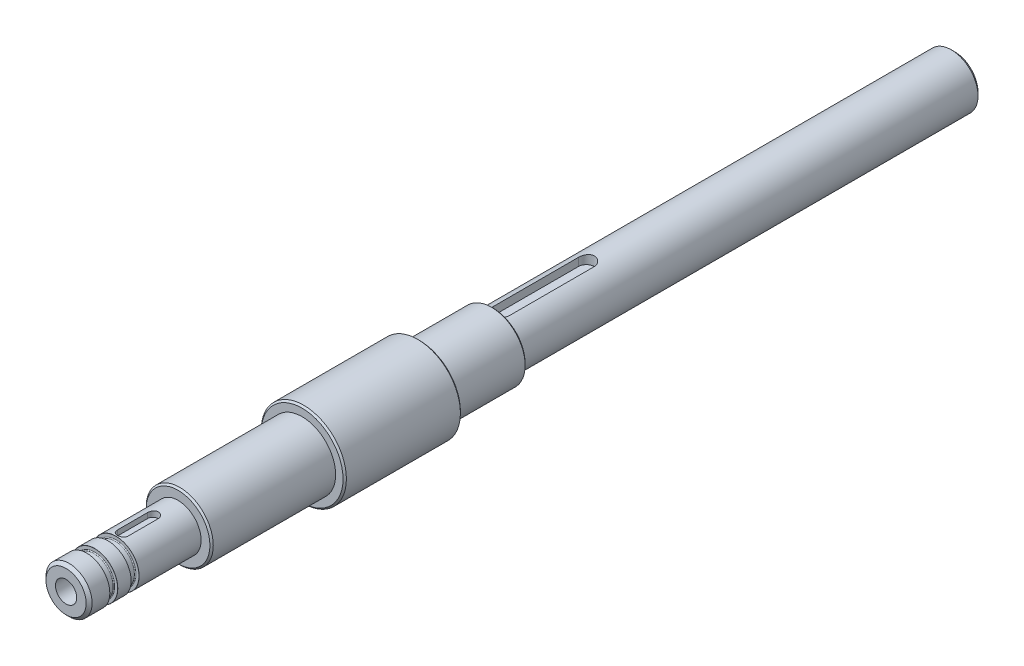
ISO-10303-21;
HEADER;
FILE_DESCRIPTION(('STEP AP214'),'2;1');
FILE_NAME('part.step','',(''),(''),'','','');
FILE_SCHEMA(('AUTOMOTIVE_DESIGN { 1 0 10303 214 1 1 1 1 }'));
ENDSEC;
DATA;
#1=APPLICATION_CONTEXT('core data for automotive mechanical design processes');
#2=APPLICATION_PROTOCOL_DEFINITION('international standard','automotive_design',2000,#1);
#3=PRODUCT_CONTEXT('',#1,'mechanical');
#4=PRODUCT('Part','Part','',(#3));
#5=PRODUCT_RELATED_PRODUCT_CATEGORY('part','',(#4));
#6=PRODUCT_DEFINITION_FORMATION('','',#4);
#7=PRODUCT_DEFINITION_CONTEXT('part definition',#1,'design');
#8=PRODUCT_DEFINITION('design','',#6,#7);
#9=PRODUCT_DEFINITION_SHAPE('','',#8);
#10=(LENGTH_UNIT() NAMED_UNIT(*) SI_UNIT(.MILLI.,.METRE.));
#11=(NAMED_UNIT(*) PLANE_ANGLE_UNIT() SI_UNIT($,.RADIAN.));
#12=(NAMED_UNIT(*) SI_UNIT($,.STERADIAN.) SOLID_ANGLE_UNIT());
#13=UNCERTAINTY_MEASURE_WITH_UNIT(LENGTH_MEASURE(1.E-05),#10,'distance_accuracy_value','');
#14=(GEOMETRIC_REPRESENTATION_CONTEXT(3) GLOBAL_UNCERTAINTY_ASSIGNED_CONTEXT((#13)) GLOBAL_UNIT_ASSIGNED_CONTEXT((#10,
#11,#12)) REPRESENTATION_CONTEXT('',''));
#15=CARTESIAN_POINT('',(0.,0.,0.));
#16=DIRECTION('',(0.,0.,1.));
#17=DIRECTION('',(1.,0.,0.));
#18=AXIS2_PLACEMENT_3D('',#15,#16,#17);
#19=CARTESIAN_POINT('',(0.,0.,150.));
#20=DIRECTION('',(0.,0.,-1.));
#21=DIRECTION('',(-1.,0.,0.));
#22=AXIS2_PLACEMENT_3D('',#19,#20,#21);
#23=CONICAL_SURFACE('',#22,6.00000000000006,0.785398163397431);
#24=CARTESIAN_POINT('',(0.,0.,150.));
#25=DIRECTION('',(0.,0.,1.));
#26=DIRECTION('',(1.,0.,0.));
#27=AXIS2_PLACEMENT_3D('',#24,#25,#26);
#28=CIRCLE('',#27,6.00000000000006);
#29=CARTESIAN_POINT('',(6.00000000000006,0.,150.));
#30=VERTEX_POINT('',#29);
#31=EDGE_CURVE('E219',#30,#30,#28,.T.);
#32=ORIENTED_EDGE('',*,*,#31,.F.);
#33=EDGE_LOOP('',(#32));
#34=FACE_BOUND('',#33,.T.);
#35=CARTESIAN_POINT('',(0.,0.,149.1166));
#36=DIRECTION('',(0.,0.,-1.));
#37=DIRECTION('',(-1.,0.,0.));
#38=AXIS2_PLACEMENT_3D('',#35,#36,#37);
#39=CIRCLE('',#38,6.8834);
#40=CARTESIAN_POINT('',(6.8834,0.,149.1166));
#41=VERTEX_POINT('',#40);
#42=EDGE_CURVE('E171',#41,#41,#39,.F.);
#43=ORIENTED_EDGE('',*,*,#42,.T.);
#44=EDGE_LOOP('',(#43));
#45=FACE_BOUND('',#44,.T.);
#46=ADVANCED_FACE('F38',(#34,#45),#23,.T.);
#47=CARTESIAN_POINT('',(0.,0.,-115.));
#48=DIRECTION('',(0.,0.,1.));
#49=DIRECTION('',(1.,0.,0.));
#50=AXIS2_PLACEMENT_3D('',#47,#48,#49);
#51=PLANE('',#50);
#52=CARTESIAN_POINT('',(0.,0.,-115.));
#53=DIRECTION('',(0.,0.,1.));
#54=DIRECTION('',(1.,0.,0.));
#55=AXIS2_PLACEMENT_3D('',#52,#53,#54);
#56=CIRCLE('',#55,6.9375000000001);
#57=CARTESIAN_POINT('',(6.9375000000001,0.,-115.));
#58=VERTEX_POINT('',#57);
#59=EDGE_CURVE('E216',#58,#58,#56,.F.);
#60=ORIENTED_EDGE('',*,*,#59,.T.);
#61=EDGE_LOOP('',(#60));
#62=FACE_BOUND('',#61,.T.);
#63=CARTESIAN_POINT('',(0.,0.,-115.));
#64=DIRECTION('',(0.,0.,1.));
#65=DIRECTION('',(1.,0.,0.));
#66=AXIS2_PLACEMENT_3D('',#63,#64,#65);
#67=CIRCLE('',#66,3.175);
#68=CARTESIAN_POINT('',(3.175,0.,-115.));
#69=VERTEX_POINT('',#68);
#70=EDGE_CURVE('E208',#69,#69,#67,.T.);
#71=ORIENTED_EDGE('',*,*,#70,.T.);
#72=EDGE_LOOP('',(#71));
#73=FACE_BOUND('',#72,.T.);
#74=ADVANCED_FACE('F355',(#62,#73),#51,.F.);
#75=CARTESIAN_POINT('',(0.,0.,79.61));
#76=DIRECTION('',(0.,0.,1.));
#77=DIRECTION('',(1.,0.,0.));
#78=AXIS2_PLACEMENT_3D('',#75,#76,#77);
#79=PLANE('',#78);
#80=CARTESIAN_POINT('',(0.,0.,79.61));
#81=DIRECTION('',(0.,0.,1.));
#82=DIRECTION('',(1.,0.,0.));
#83=AXIS2_PLACEMENT_3D('',#80,#81,#82);
#84=CIRCLE('',#83,12.2);
#85=CARTESIAN_POINT('',(12.2,0.,79.61));
#86=VERTEX_POINT('',#85);
#87=EDGE_CURVE('E237',#86,#86,#84,.T.);
#88=ORIENTED_EDGE('',*,*,#87,.T.);
#89=EDGE_LOOP('',(#88));
#90=FACE_BOUND('',#89,.T.);
#91=CARTESIAN_POINT('',(0.,0.,79.61));
#92=DIRECTION('',(0.,0.,1.));
#93=DIRECTION('',(1.,0.,0.));
#94=AXIS2_PLACEMENT_3D('',#91,#92,#93);
#95=CIRCLE('',#94,10.);
#96=CARTESIAN_POINT('',(10.,0.,79.61));
#97=VERTEX_POINT('',#96);
#98=EDGE_CURVE('E204',#97,#97,#95,.T.);
#99=ORIENTED_EDGE('',*,*,#98,.F.);
#100=EDGE_LOOP('',(#99));
#101=FACE_BOUND('',#100,.T.);
#102=ADVANCED_FACE('F361',(#90,#101),#79,.T.);
#103=CARTESIAN_POINT('',(0.,0.,-115.));
#104=DIRECTION('',(0.,0.,1.));
#105=DIRECTION('',(1.,0.,0.));
#106=AXIS2_PLACEMENT_3D('',#103,#104,#105);
#107=CYLINDRICAL_SURFACE('',#106,12.7);
#108=CARTESIAN_POINT('',(0.,0.,45.11));
#109=DIRECTION('',(0.,0.,1.));
#110=DIRECTION('',(1.,0.,0.));
#111=AXIS2_PLACEMENT_3D('',#108,#109,#110);
#112=CIRCLE('',#111,12.7);
#113=CARTESIAN_POINT('',(12.7,0.,45.11));
#114=VERTEX_POINT('',#113);
#115=EDGE_CURVE('E234',#114,#114,#112,.T.);
#116=ORIENTED_EDGE('',*,*,#115,.T.);
#117=EDGE_LOOP('',(#116));
#118=FACE_BOUND('',#117,.T.);
#119=CARTESIAN_POINT('',(0.,0.,79.11));
#120=DIRECTION('',(0.,0.,1.));
#121=DIRECTION('',(1.,0.,0.));
#122=AXIS2_PLACEMENT_3D('',#119,#120,#121);
#123=CIRCLE('',#122,12.7);
#124=CARTESIAN_POINT('',(12.7,0.,79.11));
#125=VERTEX_POINT('',#124);
#126=EDGE_CURVE('E231',#125,#125,#123,.F.);
#127=ORIENTED_EDGE('',*,*,#126,.T.);
#128=EDGE_LOOP('',(#127));
#129=FACE_BOUND('',#128,.T.);
#130=ADVANCED_FACE('F696',(#118,#129),#107,.T.);
#131=CARTESIAN_POINT('',(0.,0.,150.));
#132=DIRECTION('',(0.,0.,1.));
#133=DIRECTION('',(1.,0.,0.));
#134=AXIS2_PLACEMENT_3D('',#131,#132,#133);
#135=PLANE('',#134);
#136=ORIENTED_EDGE('',*,*,#31,.T.);
#137=EDGE_LOOP('',(#136));
#138=FACE_BOUND('',#137,.T.);
#139=CARTESIAN_POINT('',(0.,0.,150.));
#140=DIRECTION('',(0.,0.,1.));
#141=DIRECTION('',(1.,0.,0.));
#142=AXIS2_PLACEMENT_3D('',#139,#140,#141);
#143=CIRCLE('',#142,3.175);
#144=CARTESIAN_POINT('',(3.175,0.,150.));
#145=VERTEX_POINT('',#144);
#146=EDGE_CURVE('E207',#145,#145,#143,.T.);
#147=ORIENTED_EDGE('',*,*,#146,.F.);
#148=EDGE_LOOP('',(#147));
#149=FACE_BOUND('',#148,.T.);
#150=ADVANCED_FACE('F350',(#138,#149),#135,.T.);
#151=CARTESIAN_POINT('',(0.,0.,-115.));
#152=DIRECTION('',(0.,0.,1.));
#153=DIRECTION('',(1.,0.,0.));
#154=AXIS2_PLACEMENT_3D('',#151,#152,#153);
#155=CYLINDRICAL_SURFACE('',#154,3.175);
#156=ORIENTED_EDGE('',*,*,#70,.F.);
#157=EDGE_LOOP('',(#156));
#158=FACE_BOUND('',#157,.T.);
#159=ORIENTED_EDGE('',*,*,#146,.T.);
#160=EDGE_LOOP('',(#159));
#161=FACE_BOUND('',#160,.T.);
#162=ADVANCED_FACE('F340',(#158,#161),#155,.F.);
#163=CARTESIAN_POINT('',(0.,0.,116.61));
#164=DIRECTION('',(0.,0.,1.));
#165=DIRECTION('',(1.,0.,0.));
#166=AXIS2_PLACEMENT_3D('',#163,#164,#165);
#167=PLANE('',#166);
#168=CARTESIAN_POINT('',(0.,0.,116.61));
#169=DIRECTION('',(0.,0.,1.));
#170=DIRECTION('',(1.,0.,0.));
#171=AXIS2_PLACEMENT_3D('',#168,#169,#170);
#172=CIRCLE('',#171,9.50000000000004);
#173=CARTESIAN_POINT('',(9.50000000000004,0.,116.61));
#174=VERTEX_POINT('',#173);
#175=EDGE_CURVE('E240',#174,#174,#172,.T.);
#176=ORIENTED_EDGE('',*,*,#175,.T.);
#177=EDGE_LOOP('',(#176));
#178=FACE_BOUND('',#177,.T.);
#179=CARTESIAN_POINT('',(0.,0.,116.61));
#180=DIRECTION('',(0.,0.,1.));
#181=DIRECTION('',(1.,0.,0.));
#182=AXIS2_PLACEMENT_3D('',#179,#180,#181);
#183=CIRCLE('',#182,6.8834);
#184=CARTESIAN_POINT('',(6.8834,0.,116.61));
#185=VERTEX_POINT('',#184);
#186=EDGE_CURVE('E151',#185,#185,#183,.F.);
#187=ORIENTED_EDGE('',*,*,#186,.T.);
#188=EDGE_LOOP('',(#187));
#189=FACE_BOUND('',#188,.T.);
#190=ADVANCED_FACE('F337',(#178,#189),#167,.T.);
#191=CARTESIAN_POINT('',(0.,0.,116.61));
#192=DIRECTION('',(0.,0.,-1.));
#193=DIRECTION('',(-1.,0.,0.));
#194=AXIS2_PLACEMENT_3D('',#191,#192,#193);
#195=CYLINDRICAL_SURFACE('',#194,10.);
#196=CARTESIAN_POINT('',(0.,0.,116.11));
#197=DIRECTION('',(0.,0.,1.));
#198=DIRECTION('',(1.,0.,0.));
#199=AXIS2_PLACEMENT_3D('',#196,#197,#198);
#200=CIRCLE('',#199,10.);
#201=CARTESIAN_POINT('',(10.,0.,116.11));
#202=VERTEX_POINT('',#201);
#203=EDGE_CURVE('E243',#202,#202,#200,.F.);
#204=ORIENTED_EDGE('',*,*,#203,.T.);
#205=EDGE_LOOP('',(#204));
#206=FACE_BOUND('',#205,.T.);
#207=ORIENTED_EDGE('',*,*,#98,.T.);
#208=EDGE_LOOP('',(#207));
#209=FACE_BOUND('',#208,.T.);
#210=ADVANCED_FACE('F339',(#206,#209),#195,.T.);
#211=CARTESIAN_POINT('',(0.,0.,44.61));
#212=DIRECTION('',(0.,0.,1.));
#213=DIRECTION('',(1.,0.,0.));
#214=AXIS2_PLACEMENT_3D('',#211,#212,#213);
#215=PLANE('',#214);
#216=CARTESIAN_POINT('',(0.,0.,44.61));
#217=DIRECTION('',(0.,0.,1.));
#218=DIRECTION('',(1.,0.,0.));
#219=AXIS2_PLACEMENT_3D('',#216,#217,#218);
#220=CIRCLE('',#219,12.2);
#221=CARTESIAN_POINT('',(12.2,0.,44.61));
#222=VERTEX_POINT('',#221);
#223=EDGE_CURVE('E228',#222,#222,#220,.F.);
#224=ORIENTED_EDGE('',*,*,#223,.T.);
#225=EDGE_LOOP('',(#224));
#226=FACE_BOUND('',#225,.T.);
#227=CARTESIAN_POINT('',(0.,0.,44.61));
#228=DIRECTION('',(0.,0.,1.));
#229=DIRECTION('',(1.,0.,0.));
#230=AXIS2_PLACEMENT_3D('',#227,#228,#229);
#231=CIRCLE('',#230,10.);
#232=CARTESIAN_POINT('',(10.,0.,44.61));
#233=VERTEX_POINT('',#232);
#234=EDGE_CURVE('E201',#233,#233,#231,.T.);
#235=ORIENTED_EDGE('',*,*,#234,.T.);
#236=EDGE_LOOP('',(#235));
#237=FACE_BOUND('',#236,.T.);
#238=ADVANCED_FACE('F347',(#226,#237),#215,.F.);
#239=CARTESIAN_POINT('',(0.,0.,-115.));
#240=DIRECTION('',(0.,0.,1.));
#241=DIRECTION('',(1.,0.,0.));
#242=AXIS2_PLACEMENT_3D('',#239,#240,#241);
#243=CYLINDRICAL_SURFACE('',#242,10.);
#244=CARTESIAN_POINT('',(0.,0.,23.11));
#245=DIRECTION('',(0.,0.,1.));
#246=DIRECTION('',(1.,0.,0.));
#247=AXIS2_PLACEMENT_3D('',#244,#245,#246);
#248=CIRCLE('',#247,10.);
#249=CARTESIAN_POINT('',(10.,0.,23.11));
#250=VERTEX_POINT('',#249);
#251=EDGE_CURVE('E225',#250,#250,#248,.T.);
#252=ORIENTED_EDGE('',*,*,#251,.T.);
#253=EDGE_LOOP('',(#252));
#254=FACE_BOUND('',#253,.T.);
#255=ORIENTED_EDGE('',*,*,#234,.F.);
#256=EDGE_LOOP('',(#255));
#257=FACE_BOUND('',#256,.T.);
#258=ADVANCED_FACE('F668',(#254,#257),#243,.T.);
#259=CARTESIAN_POINT('',(0.,0.,22.61));
#260=DIRECTION('',(0.,0.,1.));
#261=DIRECTION('',(1.,0.,0.));
#262=AXIS2_PLACEMENT_3D('',#259,#260,#261);
#263=PLANE('',#262);
#264=CARTESIAN_POINT('',(0.,0.,22.61));
#265=DIRECTION('',(0.,0.,1.));
#266=DIRECTION('',(1.,0.,0.));
#267=AXIS2_PLACEMENT_3D('',#264,#265,#266);
#268=CIRCLE('',#267,9.5);
#269=CARTESIAN_POINT('',(9.5,0.,22.61));
#270=VERTEX_POINT('',#269);
#271=EDGE_CURVE('E222',#270,#270,#268,.F.);
#272=ORIENTED_EDGE('',*,*,#271,.T.);
#273=EDGE_LOOP('',(#272));
#274=FACE_BOUND('',#273,.T.);
#275=CARTESIAN_POINT('',(0.,0.,22.61));
#276=DIRECTION('',(0.,0.,1.));
#277=DIRECTION('',(1.,0.,0.));
#278=AXIS2_PLACEMENT_3D('',#275,#276,#277);
#279=CIRCLE('',#278,7.9375);
#280=CARTESIAN_POINT('',(0.,7.9375,22.61));
#281=VERTEX_POINT('',#280);
#282=EDGE_CURVE('E198',#281,#281,#279,.T.);
#283=ORIENTED_EDGE('',*,*,#282,.T.);
#284=EDGE_LOOP('',(#283));
#285=FACE_BOUND('',#284,.T.);
#286=ADVANCED_FACE('F661',(#274,#285),#263,.F.);
#287=CARTESIAN_POINT('',(0.,0.,-115.));
#288=DIRECTION('',(0.,0.,1.));
#289=DIRECTION('',(1.,0.,0.));
#290=AXIS2_PLACEMENT_3D('',#287,#288,#289);
#291=CYLINDRICAL_SURFACE('',#290,7.9375);
#292=CARTESIAN_POINT('',(2.38125,7.57189241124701,-5.17125));
#293=CARTESIAN_POINT('',(2.38125815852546,7.57188330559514,-5.23660381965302));
#294=CARTESIAN_POINT('',(2.378559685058,7.572738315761,-5.30195241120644));
#295=CARTESIAN_POINT('',(2.36781294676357,7.57610889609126,-5.43215082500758));
#296=CARTESIAN_POINT('',(2.35976588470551,7.57862409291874,-5.49700075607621));
#297=CARTESIAN_POINT('',(2.33841242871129,7.58523905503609,-5.62558052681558));
#298=CARTESIAN_POINT('',(2.32511938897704,7.58933479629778,-5.68931278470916));
#299=CARTESIAN_POINT('',(2.29340452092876,7.59897853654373,-5.81535895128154));
#300=CARTESIAN_POINT('',(2.27498255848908,7.60452657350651,-5.87767282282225));
#301=CARTESIAN_POINT('',(2.21224938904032,7.62310862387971,-6.06179732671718));
#302=CARTESIAN_POINT('',(2.16044345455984,7.63808962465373,-6.18095432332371));
#303=CARTESIAN_POINT('',(2.0384694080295,7.67153988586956,-6.40888567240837));
#304=CARTESIAN_POINT('',(1.96829275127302,7.69001076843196,-6.51765516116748));
#305=CARTESIAN_POINT('',(1.80919341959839,7.72901085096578,-6.72519262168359));
#306=CARTESIAN_POINT('',(1.71979363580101,7.74958369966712,-6.82358736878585));
#307=CARTESIAN_POINT('',(1.52580765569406,7.79009767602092,-7.00423593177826));
#308=CARTESIAN_POINT('',(1.4212188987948,7.81003869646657,-7.08648702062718));
#309=CARTESIAN_POINT('',(1.19714960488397,7.84754016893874,-7.23414819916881));
#310=CARTESIAN_POINT('',(1.07740582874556,7.86504286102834,-7.29917483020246));
#311=CARTESIAN_POINT('',(0.828073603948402,7.89518471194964,-7.40801924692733));
#312=CARTESIAN_POINT('',(0.698487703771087,7.9078251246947,-7.45184250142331));
#313=CARTESIAN_POINT('',(0.437077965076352,7.92650878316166,-7.51579664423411));
#314=CARTESIAN_POINT('',(0.305424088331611,7.93273034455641,-7.53656920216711));
#315=CARTESIAN_POINT('',(0.040359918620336,7.93850333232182,-7.55586128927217));
#316=CARTESIAN_POINT('',(-0.0930500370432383,7.93805602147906,-7.5543850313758));
#317=CARTESIAN_POINT('',(-0.353332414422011,7.93066744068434,-7.52965125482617));
#318=CARTESIAN_POINT('',(-0.480277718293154,7.92393347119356,-7.50708901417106));
#319=CARTESIAN_POINT('',(-0.728487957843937,7.90498028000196,-7.44195977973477));
#320=CARTESIAN_POINT('',(-0.849752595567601,7.89276077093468,-7.39939173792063));
#321=CARTESIAN_POINT('',(-1.08481465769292,7.86392278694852,-7.29498809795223));
#322=CARTESIAN_POINT('',(-1.19850853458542,7.84725468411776,-7.23293363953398));
#323=CARTESIAN_POINT('',(-1.41409027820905,7.8112877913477,-7.09149223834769));
#324=CARTESIAN_POINT('',(-1.5159754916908,7.79198841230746,-7.01210141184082));
#325=CARTESIAN_POINT('',(-1.70918902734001,7.75194781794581,-6.83464521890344));
#326=CARTESIAN_POINT('',(-1.79996070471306,7.73117969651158,-6.73597911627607));
#327=CARTESIAN_POINT('',(-1.96384496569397,7.69118691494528,-6.52459784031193));
#328=CARTESIAN_POINT('',(-2.0369523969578,7.67196270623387,-6.41187858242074));
#329=CARTESIAN_POINT('',(-2.1640229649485,7.63710100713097,-6.17410402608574));
#330=CARTESIAN_POINT('',(-2.21778522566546,7.62150171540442,-6.04893560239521));
#331=CARTESIAN_POINT('',(-2.30323844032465,7.59611866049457,-5.79081234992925));
#332=CARTESIAN_POINT('',(-2.33496315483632,7.58632600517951,-5.65786977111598));
#333=CARTESIAN_POINT('',(-2.36380660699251,7.57736026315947,-5.46494561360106));
#334=CARTESIAN_POINT('',(-2.37034709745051,7.57531435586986,-5.40637345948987));
#335=CARTESIAN_POINT('',(-2.37906489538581,7.57258024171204,-5.28896077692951));
#336=CARTESIAN_POINT('',(-2.38124861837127,7.57189003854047,-5.23012077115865));
#337=CARTESIAN_POINT('',(-2.38125,7.57189241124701,-5.17125));
#338=B_SPLINE_CURVE_WITH_KNOTS('',3,(#292,#293,#294,#295,#296,#297,#298,#299,#300,#301,#302,
#303,#304,#305,#306,#307,#308,#309,#310,#311,#312,#313,#314,#315,#316,#317,#318,#319,#320,#321,
#322,#323,#324,#325,#326,#327,#328,#329,#330,#331,#332,#333,#334,#335,#336,#337),.UNSPECIFIED.,
.F.,.F.,(4,2,2,2,2,2,2,2,2,2,2,2,2,2,2,2,2,2,2,2,2,2,4),(0.,0.195991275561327,0.391938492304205,
0.587390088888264,0.782846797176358,1.17326844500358,1.56387201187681,1.96560376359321,
2.36740331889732,2.77751230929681,3.1875154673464,3.58579420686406,3.98399753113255,
4.36951721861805,4.7550571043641,5.14509213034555,5.53521462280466,5.94033955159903,
6.34558250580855,6.7549196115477,7.16362823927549,7.34039575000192,7.51690277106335),.UNSPECIFIED.);
#339=CARTESIAN_POINT('',(2.38125,7.57189241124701,-5.17125));
#340=VERTEX_POINT('',#339);
#341=CARTESIAN_POINT('',(-2.38125,7.57189241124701,-5.17125));
#342=VERTEX_POINT('',#341);
#343=EDGE_CURVE('E258',#340,#342,#338,.T.);
#344=ORIENTED_EDGE('',*,*,#343,.F.);
#345=DIRECTION('',(0.,0.,1.));
#346=VECTOR('',#345,1.);
#347=CARTESIAN_POINT('',(2.38124999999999,7.57189241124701,-115.));
#348=LINE('',#347,#346);
#349=CARTESIAN_POINT('',(2.38125,7.57189241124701,20.22875));
#350=VERTEX_POINT('',#349);
#351=EDGE_CURVE('E300',#350,#340,#348,.F.);
#352=ORIENTED_EDGE('',*,*,#351,.F.);
#353=CARTESIAN_POINT('',(-2.38125,7.57189241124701,20.22875));
#354=CARTESIAN_POINT('',(-2.38125815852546,7.57188330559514,20.294103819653));
#355=CARTESIAN_POINT('',(-2.378559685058,7.572738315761,20.3594524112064));
#356=CARTESIAN_POINT('',(-2.36781294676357,7.57610889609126,20.4896508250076));
#357=CARTESIAN_POINT('',(-2.35976588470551,7.57862409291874,20.5545007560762));
#358=CARTESIAN_POINT('',(-2.3384124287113,7.58523905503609,20.6830805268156));
#359=CARTESIAN_POINT('',(-2.32511938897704,7.58933479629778,20.7468127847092));
#360=CARTESIAN_POINT('',(-2.29340452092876,7.59897853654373,20.8728589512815));
#361=CARTESIAN_POINT('',(-2.27498255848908,7.60452657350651,20.9351728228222));
#362=CARTESIAN_POINT('',(-2.21224938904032,7.62310862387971,21.1192973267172));
#363=CARTESIAN_POINT('',(-2.16044345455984,7.63808962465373,21.2384543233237));
#364=CARTESIAN_POINT('',(-2.0384694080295,7.67153988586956,21.4663856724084));
#365=CARTESIAN_POINT('',(-1.96829275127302,7.69001076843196,21.5751551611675));
#366=CARTESIAN_POINT('',(-1.80919341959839,7.72901085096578,21.7826926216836));
#367=CARTESIAN_POINT('',(-1.71979363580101,7.74958369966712,21.8810873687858));
#368=CARTESIAN_POINT('',(-1.52580765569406,7.79009767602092,22.0617359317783));
#369=CARTESIAN_POINT('',(-1.4212188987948,7.81003869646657,22.1439870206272));
#370=CARTESIAN_POINT('',(-1.19714960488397,7.84754016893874,22.2916481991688));
#371=CARTESIAN_POINT('',(-1.07740582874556,7.86504286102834,22.3566748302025));
#372=CARTESIAN_POINT('',(-0.828073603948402,7.89518471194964,22.4655192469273));
#373=CARTESIAN_POINT('',(-0.698487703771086,7.9078251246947,22.5093425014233));
#374=CARTESIAN_POINT('',(-0.43707796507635,7.92650878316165,22.5732966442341));
#375=CARTESIAN_POINT('',(-0.305424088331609,7.93273034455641,22.5940692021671));
#376=CARTESIAN_POINT('',(-0.0403599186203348,7.93850333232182,22.6133612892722));
#377=CARTESIAN_POINT('',(0.0930500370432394,7.93805602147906,22.6118850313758));
#378=CARTESIAN_POINT('',(0.353332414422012,7.93066744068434,22.5871512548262));
#379=CARTESIAN_POINT('',(0.480277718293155,7.92393347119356,22.5645890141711));
#380=CARTESIAN_POINT('',(0.728487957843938,7.90498028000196,22.4994597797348));
#381=CARTESIAN_POINT('',(0.849752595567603,7.89276077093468,22.4568917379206));
#382=CARTESIAN_POINT('',(1.08481465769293,7.86392278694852,22.3524880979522));
#383=CARTESIAN_POINT('',(1.19850853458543,7.84725468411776,22.290433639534));
#384=CARTESIAN_POINT('',(1.41409027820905,7.8112877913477,22.1489922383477));
#385=CARTESIAN_POINT('',(1.5159754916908,7.79198841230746,22.0696014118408));
#386=CARTESIAN_POINT('',(1.70918902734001,7.75194781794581,21.8921452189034));
#387=CARTESIAN_POINT('',(1.79996070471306,7.73117969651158,21.7934791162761));
#388=CARTESIAN_POINT('',(1.96384496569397,7.69118691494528,21.5820978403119));
#389=CARTESIAN_POINT('',(2.03695239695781,7.67196270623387,21.4693785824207));
#390=CARTESIAN_POINT('',(2.16402296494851,7.63710100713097,21.2316040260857));
#391=CARTESIAN_POINT('',(2.21778522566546,7.62150171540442,21.1064356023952));
#392=CARTESIAN_POINT('',(2.30323844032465,7.59611866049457,20.8483123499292));
#393=CARTESIAN_POINT('',(2.33496315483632,7.58632600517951,20.715369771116));
#394=CARTESIAN_POINT('',(2.36380660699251,7.57736026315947,20.5224456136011));
#395=CARTESIAN_POINT('',(2.37034709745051,7.57531435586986,20.4638734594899));
#396=CARTESIAN_POINT('',(2.37906489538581,7.57258024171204,20.3464607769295));
#397=CARTESIAN_POINT('',(2.38124861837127,7.57189003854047,20.2876207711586));
#398=CARTESIAN_POINT('',(2.38125,7.57189241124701,20.22875));
#399=B_SPLINE_CURVE_WITH_KNOTS('',3,(#353,#354,#355,#356,#357,#358,#359,#360,#361,#362,#363,
#364,#365,#366,#367,#368,#369,#370,#371,#372,#373,#374,#375,#376,#377,#378,#379,#380,#381,#382,
#383,#384,#385,#386,#387,#388,#389,#390,#391,#392,#393,#394,#395,#396,#397,#398),.UNSPECIFIED.,
.F.,.F.,(4,2,2,2,2,2,2,2,2,2,2,2,2,2,2,2,2,2,2,2,2,2,4),(0.,0.195991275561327,0.391938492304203,
0.587390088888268,0.782846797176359,1.17326844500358,1.56387201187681,1.96560376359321,
2.36740331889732,2.77751230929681,3.1875154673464,3.58579420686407,3.98399753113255,
4.36951721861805,4.7550571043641,5.14509213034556,5.53521462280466,5.94033955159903,
6.34558250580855,6.7549196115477,7.1636282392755,7.34039575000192,7.51690277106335),.UNSPECIFIED.);
#400=EDGE_CURVE('E294',#281,#350,#399,.T.);
#401=ORIENTED_EDGE('',*,*,#400,.F.);
#402=ORIENTED_EDGE('',*,*,#282,.F.);
#403=CARTESIAN_POINT('',(-2.38125,7.57189241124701,20.22875));
#404=VERTEX_POINT('',#403);
#405=EDGE_CURVE('E299',#404,#281,#399,.T.);
#406=ORIENTED_EDGE('',*,*,#405,.F.);
#407=DIRECTION('',(0.,0.,1.));
#408=VECTOR('',#407,1.);
#409=CARTESIAN_POINT('',(-2.38124999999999,7.57189241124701,-115.));
#410=LINE('',#409,#408);
#411=EDGE_CURVE('E267',#342,#404,#410,.T.);
#412=ORIENTED_EDGE('',*,*,#411,.F.);
#413=EDGE_LOOP('',(#344,#352,#401,#402,#406,#412));
#414=FACE_BOUND('',#413,.T.);
#415=CARTESIAN_POINT('',(0.,0.,-114.));
#416=DIRECTION('',(0.,0.,1.));
#417=DIRECTION('',(1.,0.,0.));
#418=AXIS2_PLACEMENT_3D('',#415,#416,#417);
#419=CIRCLE('',#418,7.9375);
#420=CARTESIAN_POINT('',(7.9375,0.,-114.));
#421=VERTEX_POINT('',#420);
#422=EDGE_CURVE('E211',#421,#421,#419,.T.);
#423=ORIENTED_EDGE('',*,*,#422,.T.);
#424=EDGE_LOOP('',(#423));
#425=FACE_BOUND('',#424,.T.);
#426=ADVANCED_FACE('F269',(#414,#425),#291,.T.);
#427=CARTESIAN_POINT('',(0.,0.,-114.));
#428=DIRECTION('',(0.,0.,1.));
#429=DIRECTION('',(1.,0.,0.));
#430=AXIS2_PLACEMENT_3D('',#427,#428,#429);
#431=CONICAL_SURFACE('',#430,7.9375,0.785398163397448);
#432=ORIENTED_EDGE('',*,*,#59,.F.);
#433=EDGE_LOOP('',(#432));
#434=FACE_BOUND('',#433,.T.);
#435=ORIENTED_EDGE('',*,*,#422,.F.);
#436=EDGE_LOOP('',(#435));
#437=FACE_BOUND('',#436,.T.);
#438=ADVANCED_FACE('F368',(#434,#437),#431,.T.);
#439=CARTESIAN_POINT('',(0.,0.,22.61));
#440=DIRECTION('',(0.,0.,1.));
#441=DIRECTION('',(1.,0.,0.));
#442=AXIS2_PLACEMENT_3D('',#439,#440,#441);
#443=CONICAL_SURFACE('',#442,9.50000000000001,0.78539816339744);
#444=ORIENTED_EDGE('',*,*,#251,.F.);
#445=EDGE_LOOP('',(#444));
#446=FACE_BOUND('',#445,.T.);
#447=ORIENTED_EDGE('',*,*,#271,.F.);
#448=EDGE_LOOP('',(#447));
#449=FACE_BOUND('',#448,.T.);
#450=ADVANCED_FACE('F370',(#446,#449),#443,.T.);
#451=CARTESIAN_POINT('',(0.,0.,44.61));
#452=DIRECTION('',(0.,0.,1.));
#453=DIRECTION('',(1.,0.,0.));
#454=AXIS2_PLACEMENT_3D('',#451,#452,#453);
#455=CONICAL_SURFACE('',#454,12.2,0.785398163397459);
#456=ORIENTED_EDGE('',*,*,#115,.F.);
#457=EDGE_LOOP('',(#456));
#458=FACE_BOUND('',#457,.T.);
#459=ORIENTED_EDGE('',*,*,#223,.F.);
#460=EDGE_LOOP('',(#459));
#461=FACE_BOUND('',#460,.T.);
#462=ADVANCED_FACE('F373',(#458,#461),#455,.T.);
#463=CARTESIAN_POINT('',(0.,0.,79.11));
#464=DIRECTION('',(0.,0.,-1.));
#465=DIRECTION('',(-1.,0.,0.));
#466=AXIS2_PLACEMENT_3D('',#463,#464,#465);
#467=CONICAL_SURFACE('',#466,12.7,0.785398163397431);
#468=ORIENTED_EDGE('',*,*,#87,.F.);
#469=EDGE_LOOP('',(#468));
#470=FACE_BOUND('',#469,.T.);
#471=ORIENTED_EDGE('',*,*,#126,.F.);
#472=EDGE_LOOP('',(#471));
#473=FACE_BOUND('',#472,.T.);
#474=ADVANCED_FACE('F377',(#470,#473),#467,.T.);
#475=CARTESIAN_POINT('',(0.,0.,116.61));
#476=DIRECTION('',(0.,0.,-1.));
#477=DIRECTION('',(-1.,0.,0.));
#478=AXIS2_PLACEMENT_3D('',#475,#476,#477);
#479=CONICAL_SURFACE('',#478,9.50000000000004,0.785398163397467);
#480=ORIENTED_EDGE('',*,*,#203,.F.);
#481=EDGE_LOOP('',(#480));
#482=FACE_BOUND('',#481,.T.);
#483=ORIENTED_EDGE('',*,*,#175,.F.);
#484=EDGE_LOOP('',(#483));
#485=FACE_BOUND('',#484,.T.);
#486=ADVANCED_FACE('F331',(#482,#485),#479,.T.);
#487=CARTESIAN_POINT('',(0.,0.,67.1157833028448));
#488=DIRECTION('',(0.,0.,1.));
#489=DIRECTION('',(1.,0.,0.));
#490=AXIS2_PLACEMENT_3D('',#487,#488,#489);
#491=CYLINDRICAL_SURFACE('',#490,6.8834);
#492=CARTESIAN_POINT('',(1.5875,6.69783840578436,124.108035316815));
#493=CARTESIAN_POINT('',(1.58750041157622,6.69783572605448,124.064008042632));
#494=CARTESIAN_POINT('',(1.58566727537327,6.69827306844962,124.020002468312));
#495=CARTESIAN_POINT('',(1.57835879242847,6.70000000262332,123.932318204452));
#496=CARTESIAN_POINT('',(1.57288399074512,6.70128946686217,123.888639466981));
#497=CARTESIAN_POINT('',(1.55107251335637,6.70638546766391,123.758730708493));
#498=CARTESIAN_POINT('',(1.52934845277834,6.71141990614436,123.673389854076));
#499=CARTESIAN_POINT('',(1.47222183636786,6.72418049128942,123.507692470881));
#500=CARTESIAN_POINT('',(1.43681940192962,6.73190661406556,123.427335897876));
#501=CARTESIAN_POINT('',(1.35337774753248,6.74917576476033,123.273668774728));
#502=CARTESIAN_POINT('',(1.30533599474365,6.75871915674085,123.200359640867));
#503=CARTESIAN_POINT('',(1.19702990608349,6.77874543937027,123.061538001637));
#504=CARTESIAN_POINT('',(1.13657448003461,6.78924137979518,122.996176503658));
#505=CARTESIAN_POINT('',(1.00556323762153,6.80987727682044,122.876419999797));
#506=CARTESIAN_POINT('',(0.935005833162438,6.82001717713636,122.822026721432));
#507=CARTESIAN_POINT('',(0.784769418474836,6.8389416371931,122.725149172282));
#508=CARTESIAN_POINT('',(0.704993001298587,6.84770887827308,122.682812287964));
#509=CARTESIAN_POINT('',(0.539225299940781,6.8627507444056,122.612206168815));
#510=CARTESIAN_POINT('',(0.453235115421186,6.86902580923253,122.583934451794));
#511=CARTESIAN_POINT('',(0.279059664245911,6.87828407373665,122.542739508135));
#512=CARTESIAN_POINT('',(0.190938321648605,6.88132247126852,122.529558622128));
#513=CARTESIAN_POINT('',(0.0136842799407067,6.88395674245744,122.51811263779));
#514=CARTESIAN_POINT('',(-0.0754483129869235,6.88355297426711,122.519845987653));
#515=CARTESIAN_POINT('',(-0.250410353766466,6.87939005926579,122.53799034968));
#516=CARTESIAN_POINT('',(-0.33627039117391,6.87569451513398,122.554123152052));
#517=CARTESIAN_POINT('',(-0.504029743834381,6.86543636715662,122.600163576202));
#518=CARTESIAN_POINT('',(-0.585928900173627,6.8588736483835,122.630071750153));
#519=CARTESIAN_POINT('',(-0.744201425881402,6.84351796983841,122.703052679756));
#520=CARTESIAN_POINT('',(-0.820525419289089,6.83470761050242,122.746228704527));
#521=CARTESIAN_POINT('',(-0.964942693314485,6.81581933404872,122.844441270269));
#522=CARTESIAN_POINT('',(-1.03303495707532,6.80574126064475,122.899479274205));
#523=CARTESIAN_POINT('',(-1.16070731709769,6.78514831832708,123.021351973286));
#524=CARTESIAN_POINT('',(-1.22005572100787,6.77462873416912,123.088428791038));
#525=CARTESIAN_POINT('',(-1.32672251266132,6.75455094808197,123.231713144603));
#526=CARTESIAN_POINT('',(-1.37403761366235,6.74499300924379,123.307923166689));
#527=CARTESIAN_POINT('',(-1.45541664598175,6.72790463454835,123.467726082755));
#528=CARTESIAN_POINT('',(-1.48942491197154,6.72038275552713,123.551348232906));
#529=CARTESIAN_POINT('',(-1.54278888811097,6.70833504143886,123.723284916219));
#530=CARTESIAN_POINT('',(-1.56216643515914,6.70380474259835,123.81159224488));
#531=CARTESIAN_POINT('',(-1.57844690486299,6.69997870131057,123.935206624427));
#532=CARTESIAN_POINT('',(-1.5818426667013,6.69917717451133,123.969709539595));
#533=CARTESIAN_POINT('',(-1.58636653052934,6.6981073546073,124.038814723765));
#534=CARTESIAN_POINT('',(-1.58749836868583,6.69783818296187,124.073416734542));
#535=CARTESIAN_POINT('',(-1.5875,6.69783840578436,124.108035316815));
#536=B_SPLINE_CURVE_WITH_KNOTS('',3,(#492,#493,#494,#495,#496,#497,#498,#499,#500,#501,#502,
#503,#504,#505,#506,#507,#508,#509,#510,#511,#512,#513,#514,#515,#516,#517,#518,#519,#520,#521,
#522,#523,#524,#525,#526,#527,#528,#529,#530,#531,#532,#533,#534,#535),.UNSPECIFIED.,.F.,.F.,(4,
2,2,2,2,2,2,2,2,2,2,2,2,2,2,2,2,2,2,2,2,4),(0.,0.131998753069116,0.263977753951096,
0.527230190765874,0.790480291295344,1.05378318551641,1.32149244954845,1.58924384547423,
1.86014022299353,2.13098877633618,2.39714049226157,2.66326451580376,2.9243554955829,
3.18545694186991,3.44864445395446,3.71186444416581,3.98113604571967,4.25048111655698,
4.52094116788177,4.79099674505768,4.89497170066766,4.99877492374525),.UNSPECIFIED.);
#537=CARTESIAN_POINT('',(1.5875,6.69783840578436,124.108035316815));
#538=VERTEX_POINT('',#537);
#539=CARTESIAN_POINT('',(-1.5875,6.69783840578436,124.108035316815));
#540=VERTEX_POINT('',#539);
#541=EDGE_CURVE('E302',#538,#540,#536,.T.);
#542=ORIENTED_EDGE('',*,*,#541,.F.);
#543=DIRECTION('',(0.,0.,1.));
#544=VECTOR('',#543,1.);
#545=CARTESIAN_POINT('',(1.58749999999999,6.69783840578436,67.1157833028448));
#546=LINE('',#545,#544);
#547=CARTESIAN_POINT('',(1.5875,6.69783840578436,133.108035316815));
#548=VERTEX_POINT('',#547);
#549=EDGE_CURVE('E12',#548,#538,#546,.F.);
#550=ORIENTED_EDGE('',*,*,#549,.F.);
#551=CARTESIAN_POINT('',(-1.5875,6.69783840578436,133.108035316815));
#552=CARTESIAN_POINT('',(-1.58750041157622,6.69783572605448,133.152062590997));
#553=CARTESIAN_POINT('',(-1.58566727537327,6.69827306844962,133.196068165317));
#554=CARTESIAN_POINT('',(-1.57835879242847,6.70000000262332,133.283752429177));
#555=CARTESIAN_POINT('',(-1.57288399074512,6.70128946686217,133.327431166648));
#556=CARTESIAN_POINT('',(-1.55107251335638,6.70638546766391,133.457339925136));
#557=CARTESIAN_POINT('',(-1.52934845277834,6.71141990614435,133.542680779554));
#558=CARTESIAN_POINT('',(-1.47222183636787,6.72418049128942,133.708378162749));
#559=CARTESIAN_POINT('',(-1.43681940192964,6.73190661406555,133.788734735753));
#560=CARTESIAN_POINT('',(-1.35337774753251,6.74917576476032,133.942401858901));
#561=CARTESIAN_POINT('',(-1.30533599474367,6.75871915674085,134.015710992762));
#562=CARTESIAN_POINT('',(-1.19702990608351,6.77874543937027,134.154532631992));
#563=CARTESIAN_POINT('',(-1.13657448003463,6.78924137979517,134.219894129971));
#564=CARTESIAN_POINT('',(-1.00556323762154,6.80987727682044,134.339650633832));
#565=CARTESIAN_POINT('',(-0.935005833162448,6.82001717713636,134.394043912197));
#566=CARTESIAN_POINT('',(-0.784769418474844,6.8389416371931,134.490921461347));
#567=CARTESIAN_POINT('',(-0.704993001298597,6.84770887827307,134.533258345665));
#568=CARTESIAN_POINT('',(-0.539225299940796,6.8627507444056,134.603864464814));
#569=CARTESIAN_POINT('',(-0.453235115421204,6.86902580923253,134.632136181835));
#570=CARTESIAN_POINT('',(-0.279059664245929,6.87828407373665,134.673331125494));
#571=CARTESIAN_POINT('',(-0.190938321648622,6.88132247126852,134.686512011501));
#572=CARTESIAN_POINT('',(-0.0136842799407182,6.88395674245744,134.697957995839));
#573=CARTESIAN_POINT('',(0.0754483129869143,6.88355297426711,134.696224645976));
#574=CARTESIAN_POINT('',(0.25041035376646,6.87939005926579,134.678080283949));
#575=CARTESIAN_POINT('',(0.336270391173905,6.87569451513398,134.661947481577));
#576=CARTESIAN_POINT('',(0.504029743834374,6.86543636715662,134.615907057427));
#577=CARTESIAN_POINT('',(0.585928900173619,6.8588736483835,134.585998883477));
#578=CARTESIAN_POINT('',(0.744201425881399,6.84351796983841,134.513017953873));
#579=CARTESIAN_POINT('',(0.82052541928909,6.83470761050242,134.469841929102));
#580=CARTESIAN_POINT('',(0.964942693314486,6.81581933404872,134.37162936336));
#581=CARTESIAN_POINT('',(1.03303495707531,6.80574126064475,134.316591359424));
#582=CARTESIAN_POINT('',(1.16070731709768,6.78514831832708,134.194718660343));
#583=CARTESIAN_POINT('',(1.22005572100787,6.77462873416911,134.127641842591));
#584=CARTESIAN_POINT('',(1.32672251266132,6.75455094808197,133.984357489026));
#585=CARTESIAN_POINT('',(1.37403761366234,6.74499300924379,133.90814746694));
#586=CARTESIAN_POINT('',(1.45541664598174,6.72790463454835,133.748344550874));
#587=CARTESIAN_POINT('',(1.48942491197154,6.72038275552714,133.664722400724));
#588=CARTESIAN_POINT('',(1.54278888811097,6.70833504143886,133.49278571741));
#589=CARTESIAN_POINT('',(1.56216643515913,6.70380474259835,133.404478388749));
#590=CARTESIAN_POINT('',(1.57844690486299,6.69997870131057,133.280864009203));
#591=CARTESIAN_POINT('',(1.5818426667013,6.69917717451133,133.246361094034));
#592=CARTESIAN_POINT('',(1.58636653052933,6.6981073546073,133.177255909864));
#593=CARTESIAN_POINT('',(1.58749836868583,6.69783818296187,133.142653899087));
#594=CARTESIAN_POINT('',(1.5875,6.69783840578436,133.108035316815));
#595=B_SPLINE_CURVE_WITH_KNOTS('',3,(#551,#552,#553,#554,#555,#556,#557,#558,#559,#560,#561,
#562,#563,#564,#565,#566,#567,#568,#569,#570,#571,#572,#573,#574,#575,#576,#577,#578,#579,#580,
#581,#582,#583,#584,#585,#586,#587,#588,#589,#590,#591,#592,#593,#594),.UNSPECIFIED.,.F.,.F.,(4,
2,2,2,2,2,2,2,2,2,2,2,2,2,2,2,2,2,2,2,2,4),(0.,0.131998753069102,0.263977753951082,
0.527230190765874,0.790480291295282,1.05378318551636,1.32149244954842,1.58924384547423,
1.86014022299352,2.13098877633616,2.39714049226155,2.66326451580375,2.9243554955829,
3.1854569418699,3.44864445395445,3.71186444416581,3.98113604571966,4.25048111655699,
4.52094116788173,4.79099674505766,4.89497170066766,4.99877492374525),.UNSPECIFIED.);
#596=CARTESIAN_POINT('',(-1.5875,6.69783840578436,133.108035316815));
#597=VERTEX_POINT('',#596);
#598=EDGE_CURVE('E46',#597,#548,#595,.T.);
#599=ORIENTED_EDGE('',*,*,#598,.F.);
#600=DIRECTION('',(0.,0.,1.));
#601=VECTOR('',#600,1.);
#602=CARTESIAN_POINT('',(-1.58750000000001,6.69783840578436,67.1157833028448));
#603=LINE('',#602,#601);
#604=EDGE_CURVE('E308',#540,#597,#603,.T.);
#605=ORIENTED_EDGE('',*,*,#604,.F.);
#606=EDGE_LOOP('',(#542,#550,#599,#605));
#607=FACE_BOUND('',#606,.T.);
#608=CARTESIAN_POINT('',(0.,0.,135.108035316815));
#609=DIRECTION('',(0.,0.,-1.));
#610=DIRECTION('',(-1.,0.,0.));
#611=AXIS2_PLACEMENT_3D('',#608,#609,#610);
#612=CIRCLE('',#611,6.8834);
#613=CARTESIAN_POINT('',(-6.8834,0.,135.108035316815));
#614=VERTEX_POINT('',#613);
#615=EDGE_CURVE('E161',#614,#614,#612,.F.);
#616=ORIENTED_EDGE('',*,*,#615,.F.);
#617=EDGE_LOOP('',(#616));
#618=FACE_BOUND('',#617,.T.);
#619=ORIENTED_EDGE('',*,*,#186,.F.);
#620=EDGE_LOOP('',(#619));
#621=FACE_BOUND('',#620,.T.);
#622=ADVANCED_FACE('F291',(#607,#618,#621),#491,.T.);
#623=CARTESIAN_POINT('',(0.,0.,143.841964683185));
#624=DIRECTION('',(0.,0.,1.));
#625=DIRECTION('',(1.,0.,0.));
#626=AXIS2_PLACEMENT_3D('',#623,#624,#625);
#627=CIRCLE('',#626,6.8834);
#628=CARTESIAN_POINT('',(6.8834,0.,143.841964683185));
#629=VERTEX_POINT('',#628);
#630=EDGE_CURVE('E168',#629,#629,#627,.F.);
#631=CARTESIAN_POINT('',(6.8834,0.,149.1166));
#632=CARTESIAN_POINT('',(6.8834,0.,149.061655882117));
#633=CARTESIAN_POINT('',(6.8834,0.,149.006711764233));
#634=CARTESIAN_POINT('',(6.8834,0.,148.896823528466));
#635=CARTESIAN_POINT('',(6.8834,0.,148.841879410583));
#636=CARTESIAN_POINT('',(6.8834,0.,148.731991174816));
#637=CARTESIAN_POINT('',(6.8834,0.,148.677047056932));
#638=CARTESIAN_POINT('',(6.8834,0.,148.567158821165));
#639=CARTESIAN_POINT('',(6.8834,0.,148.512214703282));
#640=CARTESIAN_POINT('',(6.8834,0.,148.402326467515));
#641=CARTESIAN_POINT('',(6.8834,0.,148.347382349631));
#642=CARTESIAN_POINT('',(6.8834,0.,148.237494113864));
#643=CARTESIAN_POINT('',(6.8834,0.,148.182549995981));
#644=CARTESIAN_POINT('',(6.8834,0.,148.072661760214));
#645=CARTESIAN_POINT('',(6.8834,0.,148.01771764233));
#646=CARTESIAN_POINT('',(6.8834,0.,147.907829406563));
#647=CARTESIAN_POINT('',(6.8834,0.,147.85288528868));
#648=CARTESIAN_POINT('',(6.8834,0.,147.742997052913));
#649=CARTESIAN_POINT('',(6.8834,0.,147.688052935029));
#650=CARTESIAN_POINT('',(6.8834,0.,147.578164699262));
#651=CARTESIAN_POINT('',(6.8834,0.,147.523220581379));
#652=CARTESIAN_POINT('',(6.8834,0.,147.413332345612));
#653=CARTESIAN_POINT('',(6.8834,0.,147.358388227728));
#654=CARTESIAN_POINT('',(6.8834,0.,147.248499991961));
#655=CARTESIAN_POINT('',(6.8834,0.,147.193555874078));
#656=CARTESIAN_POINT('',(6.8834,0.,147.083667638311));
#657=CARTESIAN_POINT('',(6.8834,0.,147.028723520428));
#658=CARTESIAN_POINT('',(6.8834,0.,146.918835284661));
#659=CARTESIAN_POINT('',(6.8834,0.,146.863891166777));
#660=CARTESIAN_POINT('',(6.8834,0.,146.75400293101));
#661=CARTESIAN_POINT('',(6.8834,0.,146.699058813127));
#662=CARTESIAN_POINT('',(6.8834,0.,146.58917057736));
#663=CARTESIAN_POINT('',(6.8834,0.,146.534226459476));
#664=CARTESIAN_POINT('',(6.8834,0.,146.424338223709));
#665=CARTESIAN_POINT('',(6.8834,0.,146.369394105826));
#666=CARTESIAN_POINT('',(6.8834,0.,146.259505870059));
#667=CARTESIAN_POINT('',(6.8834,0.,146.204561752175));
#668=CARTESIAN_POINT('',(6.8834,0.,146.094673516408));
#669=CARTESIAN_POINT('',(6.8834,0.,146.039729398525));
#670=CARTESIAN_POINT('',(6.8834,0.,145.929841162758));
#671=CARTESIAN_POINT('',(6.8834,0.,145.874897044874));
#672=CARTESIAN_POINT('',(6.8834,0.,145.765008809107));
#673=CARTESIAN_POINT('',(6.8834,0.,145.710064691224));
#674=CARTESIAN_POINT('',(6.8834,0.,145.600176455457));
#675=CARTESIAN_POINT('',(6.8834,0.,145.545232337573));
#676=CARTESIAN_POINT('',(6.8834,0.,145.435344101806));
#677=CARTESIAN_POINT('',(6.8834,0.,145.380399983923));
#678=CARTESIAN_POINT('',(6.8834,0.,145.270511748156));
#679=CARTESIAN_POINT('',(6.8834,0.,145.215567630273));
#680=CARTESIAN_POINT('',(6.8834,0.,145.105679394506));
#681=CARTESIAN_POINT('',(6.8834,0.,145.050735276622));
#682=CARTESIAN_POINT('',(6.8834,0.,144.940847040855));
#683=CARTESIAN_POINT('',(6.8834,0.,144.885902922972));
#684=CARTESIAN_POINT('',(6.8834,0.,144.776014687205));
#685=CARTESIAN_POINT('',(6.8834,0.,144.721070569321));
#686=CARTESIAN_POINT('',(6.8834,0.,144.611182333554));
#687=CARTESIAN_POINT('',(6.8834,0.,144.556238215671));
#688=CARTESIAN_POINT('',(6.8834,0.,144.446349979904));
#689=CARTESIAN_POINT('',(6.8834,0.,144.39140586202));
#690=CARTESIAN_POINT('',(6.8834,0.,144.281517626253));
#691=CARTESIAN_POINT('',(6.8834,0.,144.22657350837));
#692=CARTESIAN_POINT('',(6.8834,0.,144.116685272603));
#693=CARTESIAN_POINT('',(6.8834,0.,144.061741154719));
#694=CARTESIAN_POINT('',(6.8834,0.,143.951852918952));
#695=CARTESIAN_POINT('',(6.8834,0.,143.896908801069));
#696=CARTESIAN_POINT('',(6.8834,0.,143.841964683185));
#697=B_SPLINE_CURVE_WITH_KNOTS('',3,(#631,#632,#633,#634,#635,#636,#637,#638,#639,#640,#641,
#642,#643,#644,#645,#646,#647,#648,#649,#650,#651,#652,#653,#654,#655,#656,#657,#658,#659,#660,
#661,#662,#663,#664,#665,#666,#667,#668,#669,#670,#671,#672,#673,#674,#675,#676,#677,#678,#679,
#680,#681,#682,#683,#684,#685,#686,#687,#688,#689,#690,#691,#692,#693,#694,#695,#696),
.UNSPECIFIED.,.F.,.F.,(4,2,2,2,2,2,2,2,2,2,2,2,2,2,2,2,2,2,2,2,2,2,2,2,2,2,2,2,2,2,2,2,4),(0.,
0.164832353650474,0.329664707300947,0.494497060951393,0.659329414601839,0.824161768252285,
0.988994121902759,1.15382647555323,1.31865882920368,1.48349118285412,1.6483235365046,
1.81315589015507,1.97798824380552,2.14282059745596,2.30765295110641,2.47248530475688,
2.63731765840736,2.8021500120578,2.96698236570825,3.13181471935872,3.2966470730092,
3.46147942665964,3.62631178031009,3.79114413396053,3.95597648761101,4.12080884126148,
4.28564119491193,4.45047354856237,4.61530590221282,4.78013825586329,4.94497060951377,
5.10980296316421,5.27463531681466),.UNSPECIFIED.);
#698=EDGE_CURVE('BSEAM330',#41,#629,#697,.T.);
#699=ORIENTED_EDGE('',*,*,#42,.F.);
#700=ORIENTED_EDGE('',*,*,#630,.F.);
#701=ORIENTED_EDGE('',*,*,#698,.T.);
#702=ORIENTED_EDGE('',*,*,#698,.F.);
#703=EDGE_LOOP('',(#699,#701,#700,#702));
#704=FACE_BOUND('',#703,.T.);
#705=ADVANCED_FACE('F330',(#704),#491,.T.);
#706=CARTESIAN_POINT('',(0.,0.,137.2271));
#707=DIRECTION('',(0.,0.,-1.));
#708=DIRECTION('',(-1.,0.,0.));
#709=AXIS2_PLACEMENT_3D('',#706,#707,#708);
#710=TOROIDAL_SURFACE('',#709,5.97139999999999,0.254000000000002);
#711=CARTESIAN_POINT('',(0.,0.,137.4811));
#712=DIRECTION('',(0.,0.,-1.));
#713=DIRECTION('',(-1.,0.,0.));
#714=AXIS2_PLACEMENT_3D('',#711,#712,#713);
#715=CIRCLE('',#714,5.97139999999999);
#716=CARTESIAN_POINT('',(-5.97139999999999,0.,137.4811));
#717=VERTEX_POINT('',#716);
#718=EDGE_CURVE('E174',#717,#717,#715,.T.);
#719=ORIENTED_EDGE('',*,*,#718,.T.);
#720=EDGE_LOOP('',(#719));
#721=FACE_BOUND('',#720,.T.);
#722=CARTESIAN_POINT('',(0.,0.,137.2271));
#723=DIRECTION('',(0.,0.,-1.));
#724=DIRECTION('',(-1.,0.,0.));
#725=AXIS2_PLACEMENT_3D('',#722,#723,#724);
#726=CIRCLE('',#725,5.71739999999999);
#727=CARTESIAN_POINT('',(-5.71739999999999,0.,137.2271));
#728=VERTEX_POINT('',#727);
#729=EDGE_CURVE('E177',#728,#728,#726,.T.);
#730=ORIENTED_EDGE('',*,*,#729,.F.);
#731=EDGE_LOOP('',(#730));
#732=FACE_BOUND('',#731,.T.);
#733=ADVANCED_FACE('F406',(#721,#732),#710,.F.);
#734=CARTESIAN_POINT('',(5.97139999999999,0.,137.4811));
#735=DIRECTION('',(0.,0.,-1.));
#736=DIRECTION('',(-1.,0.,0.));
#737=AXIS2_PLACEMENT_3D('',#734,#735,#736);
#738=PLANE('',#737);
#739=CARTESIAN_POINT('',(0.,0.,137.4811));
#740=DIRECTION('',(0.,0.,-1.));
#741=DIRECTION('',(-1.,0.,0.));
#742=AXIS2_PLACEMENT_3D('',#739,#740,#741);
#743=CIRCLE('',#742,6.8222);
#744=CARTESIAN_POINT('',(-6.8222,0.,137.4811));
#745=VERTEX_POINT('',#744);
#746=EDGE_CURVE('E252',#745,#745,#743,.T.);
#747=ORIENTED_EDGE('',*,*,#746,.T.);
#748=EDGE_LOOP('',(#747));
#749=FACE_BOUND('',#748,.T.);
#750=ORIENTED_EDGE('',*,*,#718,.F.);
#751=EDGE_LOOP('',(#750));
#752=FACE_BOUND('',#751,.T.);
#753=ADVANCED_FACE('F397',(#749,#752),#738,.T.);
#754=CARTESIAN_POINT('',(0.,0.,137.6589));
#755=DIRECTION('',(0.,0.,-1.));
#756=DIRECTION('',(-1.,0.,0.));
#757=AXIS2_PLACEMENT_3D('',#754,#755,#756);
#758=TOROIDAL_SURFACE('',#757,6.8222,0.1778);
#759=ORIENTED_EDGE('',*,*,#746,.F.);
#760=EDGE_LOOP('',(#759));
#761=FACE_BOUND('',#760,.T.);
#762=CARTESIAN_POINT('',(0.,0.,137.491964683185));
#763=DIRECTION('',(0.,0.,1.));
#764=DIRECTION('',(1.,0.,0.));
#765=AXIS2_PLACEMENT_3D('',#762,#763,#764);
#766=CIRCLE('',#765,6.8834);
#767=CARTESIAN_POINT('',(6.8834,0.,137.491964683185));
#768=VERTEX_POINT('',#767);
#769=EDGE_CURVE('E162',#768,#768,#766,.F.);
#770=ORIENTED_EDGE('',*,*,#769,.T.);
#771=EDGE_LOOP('',(#770));
#772=FACE_BOUND('',#771,.T.);
#773=ADVANCED_FACE('F394',(#761,#772),#758,.T.);
#774=CARTESIAN_POINT('',(0.,0.,-115.));
#775=DIRECTION('',(0.,0.,-1.));
#776=DIRECTION('',(-1.,0.,0.));
#777=AXIS2_PLACEMENT_3D('',#774,#775,#776);
#778=CYLINDRICAL_SURFACE('',#777,5.71739999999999);
#779=ORIENTED_EDGE('',*,*,#729,.T.);
#780=EDGE_LOOP('',(#779));
#781=FACE_BOUND('',#780,.T.);
#782=CARTESIAN_POINT('',(0.,0.,135.3729));
#783=DIRECTION('',(0.,0.,-1.));
#784=DIRECTION('',(-1.,0.,0.));
#785=AXIS2_PLACEMENT_3D('',#782,#783,#784);
#786=CIRCLE('',#785,5.71739999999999);
#787=CARTESIAN_POINT('',(-5.71739999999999,0.,135.3729));
#788=VERTEX_POINT('',#787);
#789=EDGE_CURVE('E180',#788,#788,#786,.T.);
#790=ORIENTED_EDGE('',*,*,#789,.F.);
#791=EDGE_LOOP('',(#790));
#792=FACE_BOUND('',#791,.T.);
#793=ADVANCED_FACE('F396',(#781,#792),#778,.T.);
#794=CARTESIAN_POINT('',(0.,0.,135.3729));
#795=DIRECTION('',(0.,0.,-1.));
#796=DIRECTION('',(-1.,0.,0.));
#797=AXIS2_PLACEMENT_3D('',#794,#795,#796);
#798=TOROIDAL_SURFACE('',#797,5.97139999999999,0.254000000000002);
#799=ORIENTED_EDGE('',*,*,#789,.T.);
#800=EDGE_LOOP('',(#799));
#801=FACE_BOUND('',#800,.T.);
#802=CARTESIAN_POINT('',(0.,0.,135.1189));
#803=DIRECTION('',(0.,0.,-1.));
#804=DIRECTION('',(-1.,0.,0.));
#805=AXIS2_PLACEMENT_3D('',#802,#803,#804);
#806=CIRCLE('',#805,5.97139999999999);
#807=CARTESIAN_POINT('',(-5.97139999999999,0.,135.1189));
#808=VERTEX_POINT('',#807);
#809=EDGE_CURVE('E183',#808,#808,#806,.T.);
#810=ORIENTED_EDGE('',*,*,#809,.F.);
#811=EDGE_LOOP('',(#810));
#812=FACE_BOUND('',#811,.T.);
#813=ADVANCED_FACE('F403',(#801,#812),#798,.F.);
#814=CARTESIAN_POINT('',(5.97139999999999,0.,135.1189));
#815=DIRECTION('',(0.,0.,1.));
#816=DIRECTION('',(1.,0.,0.));
#817=AXIS2_PLACEMENT_3D('',#814,#815,#816);
#818=PLANE('',#817);
#819=CARTESIAN_POINT('',(0.,0.,135.1189));
#820=DIRECTION('',(0.,0.,1.));
#821=DIRECTION('',(1.,0.,0.));
#822=AXIS2_PLACEMENT_3D('',#819,#820,#821);
#823=CIRCLE('',#822,6.8222);
#824=CARTESIAN_POINT('',(6.8222,0.,135.1189));
#825=VERTEX_POINT('',#824);
#826=EDGE_CURVE('E255',#825,#825,#823,.T.);
#827=ORIENTED_EDGE('',*,*,#826,.T.);
#828=EDGE_LOOP('',(#827));
#829=FACE_BOUND('',#828,.T.);
#830=ORIENTED_EDGE('',*,*,#809,.T.);
#831=EDGE_LOOP('',(#830));
#832=FACE_BOUND('',#831,.T.);
#833=ADVANCED_FACE('F421',(#829,#832),#818,.T.);
#834=CARTESIAN_POINT('',(0.,0.,134.9411));
#835=DIRECTION('',(0.,0.,1.));
#836=DIRECTION('',(1.,0.,0.));
#837=AXIS2_PLACEMENT_3D('',#834,#835,#836);
#838=TOROIDAL_SURFACE('',#837,6.8222,0.1778);
#839=ORIENTED_EDGE('',*,*,#826,.F.);
#840=EDGE_LOOP('',(#839));
#841=FACE_BOUND('',#840,.T.);
#842=ORIENTED_EDGE('',*,*,#615,.T.);
#843=EDGE_LOOP('',(#842));
#844=FACE_BOUND('',#843,.T.);
#845=ADVANCED_FACE('F40',(#841,#844),#838,.T.);
#846=CARTESIAN_POINT('',(0.,0.,141.458035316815));
#847=DIRECTION('',(0.,0.,-1.));
#848=DIRECTION('',(-1.,0.,0.));
#849=AXIS2_PLACEMENT_3D('',#846,#847,#848);
#850=CIRCLE('',#849,6.8834);
#851=CARTESIAN_POINT('',(6.8834,0.,141.458035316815));
#852=VERTEX_POINT('',#851);
#853=EDGE_CURVE('E165',#852,#852,#850,.F.);
#854=CARTESIAN_POINT('',(6.8834,0.,141.458035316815));
#855=CARTESIAN_POINT('',(6.8834,0.,141.416722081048));
#856=CARTESIAN_POINT('',(6.8834,0.,141.375408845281));
#857=CARTESIAN_POINT('',(6.8834,0.,141.292782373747));
#858=CARTESIAN_POINT('',(6.8834,0.,141.25146913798));
#859=CARTESIAN_POINT('',(6.8834,0.,141.168842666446));
#860=CARTESIAN_POINT('',(6.8834,0.,141.127529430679));
#861=CARTESIAN_POINT('',(6.8834,0.,141.044902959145));
#862=CARTESIAN_POINT('',(6.8834,0.,141.003589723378));
#863=CARTESIAN_POINT('',(6.8834,0.,140.920963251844));
#864=CARTESIAN_POINT('',(6.8834,0.,140.879650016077));
#865=CARTESIAN_POINT('',(6.8834,0.,140.797023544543));
#866=CARTESIAN_POINT('',(6.8834,0.,140.755710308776));
#867=CARTESIAN_POINT('',(6.8834,0.,140.673083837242));
#868=CARTESIAN_POINT('',(6.8834,0.,140.631770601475));
#869=CARTESIAN_POINT('',(6.8834,0.,140.549144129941));
#870=CARTESIAN_POINT('',(6.8834,0.,140.507830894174));
#871=CARTESIAN_POINT('',(6.8834,0.,140.42520442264));
#872=CARTESIAN_POINT('',(6.8834,0.,140.383891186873));
#873=CARTESIAN_POINT('',(6.8834,0.,140.301264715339));
#874=CARTESIAN_POINT('',(6.8834,0.,140.259951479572));
#875=CARTESIAN_POINT('',(6.8834,0.,140.177325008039));
#876=CARTESIAN_POINT('',(6.8834,0.,140.136011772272));
#877=CARTESIAN_POINT('',(6.8834,0.,140.053385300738));
#878=CARTESIAN_POINT('',(6.8834,0.,140.012072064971));
#879=CARTESIAN_POINT('',(6.8834,0.,139.929445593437));
#880=CARTESIAN_POINT('',(6.8834,0.,139.88813235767));
#881=CARTESIAN_POINT('',(6.8834,0.,139.805505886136));
#882=CARTESIAN_POINT('',(6.8834,0.,139.764192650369));
#883=CARTESIAN_POINT('',(6.8834,0.,139.681566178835));
#884=CARTESIAN_POINT('',(6.8834,0.,139.640252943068));
#885=CARTESIAN_POINT('',(6.8834,0.,139.557626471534));
#886=CARTESIAN_POINT('',(6.8834,0.,139.516313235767));
#887=CARTESIAN_POINT('',(6.8834,0.,139.433686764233));
#888=CARTESIAN_POINT('',(6.8834,0.,139.392373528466));
#889=CARTESIAN_POINT('',(6.8834,0.,139.309747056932));
#890=CARTESIAN_POINT('',(6.8834,0.,139.268433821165));
#891=CARTESIAN_POINT('',(6.8834,0.,139.185807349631));
#892=CARTESIAN_POINT('',(6.8834,0.,139.144494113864));
#893=CARTESIAN_POINT('',(6.8834,0.,139.06186764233));
#894=CARTESIAN_POINT('',(6.8834,0.,139.020554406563));
#895=CARTESIAN_POINT('',(6.8834,0.,138.937927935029));
#896=CARTESIAN_POINT('',(6.8834,0.,138.896614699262));
#897=CARTESIAN_POINT('',(6.8834,0.,138.813988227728));
#898=CARTESIAN_POINT('',(6.8834,0.,138.772674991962));
#899=CARTESIAN_POINT('',(6.8834,0.,138.690048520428));
#900=CARTESIAN_POINT('',(6.8834,0.,138.648735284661));
#901=CARTESIAN_POINT('',(6.8834,0.,138.566108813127));
#902=CARTESIAN_POINT('',(6.8834,0.,138.52479557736));
#903=CARTESIAN_POINT('',(6.8834,0.,138.442169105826));
#904=CARTESIAN_POINT('',(6.8834,0.,138.400855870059));
#905=CARTESIAN_POINT('',(6.8834,0.,138.318229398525));
#906=CARTESIAN_POINT('',(6.8834,0.,138.276916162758));
#907=CARTESIAN_POINT('',(6.8834,0.,138.194289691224));
#908=CARTESIAN_POINT('',(6.8834,0.,138.152976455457));
#909=CARTESIAN_POINT('',(6.8834,0.,138.070349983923));
#910=CARTESIAN_POINT('',(6.8834,0.,138.029036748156));
#911=CARTESIAN_POINT('',(6.8834,0.,137.946410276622));
#912=CARTESIAN_POINT('',(6.8834,0.,137.905097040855));
#913=CARTESIAN_POINT('',(6.8834,0.,137.822470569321));
#914=CARTESIAN_POINT('',(6.8834,0.,137.781157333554));
#915=CARTESIAN_POINT('',(6.8834,0.,137.69853086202));
#916=CARTESIAN_POINT('',(6.8834,0.,137.657217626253));
#917=CARTESIAN_POINT('',(6.8834,0.,137.574591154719));
#918=CARTESIAN_POINT('',(6.8834,0.,137.533277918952));
#919=CARTESIAN_POINT('',(6.8834,0.,137.491964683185));
#920=B_SPLINE_CURVE_WITH_KNOTS('',3,(#854,#855,#856,#857,#858,#859,#860,#861,#862,#863,#864,
#865,#866,#867,#868,#869,#870,#871,#872,#873,#874,#875,#876,#877,#878,#879,#880,#881,#882,#883,
#884,#885,#886,#887,#888,#889,#890,#891,#892,#893,#894,#895,#896,#897,#898,#899,#900,#901,#902,
#903,#904,#905,#906,#907,#908,#909,#910,#911,#912,#913,#914,#915,#916,#917,#918,#919),
.UNSPECIFIED.,.F.,.F.,(4,2,2,2,2,2,2,2,2,2,2,2,2,2,2,2,2,2,2,2,2,2,2,2,2,2,2,2,2,2,2,2,4),(0.,
0.12393970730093,0.247879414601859,0.371819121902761,0.495758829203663,0.619698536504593,
0.743638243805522,0.867577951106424,0.991517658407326,1.11545736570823,1.23939707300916,
1.36333678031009,1.48727648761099,1.61121619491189,1.73515590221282,1.85909560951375,
1.98303531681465,2.10697502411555,2.23091473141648,2.35485443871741,2.47879414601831,
2.60273385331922,2.72667356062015,2.85061326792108,2.97455297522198,3.09849268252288,
3.22243238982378,3.34637209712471,3.47031180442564,3.59425151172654,3.71819121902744,
3.84213092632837,3.9660706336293),.UNSPECIFIED.);
#921=EDGE_CURVE('BSEAM332',#852,#768,#920,.T.);
#922=ORIENTED_EDGE('',*,*,#853,.F.);
#923=ORIENTED_EDGE('',*,*,#769,.F.);
#924=ORIENTED_EDGE('',*,*,#921,.T.);
#925=ORIENTED_EDGE('',*,*,#921,.F.);
#926=EDGE_LOOP('',(#922,#924,#923,#925));
#927=FACE_BOUND('',#926,.T.);
#928=ADVANCED_FACE('F332',(#927),#491,.T.);
#929=CARTESIAN_POINT('',(0.,0.,143.5771));
#930=DIRECTION('',(0.,0.,-1.));
#931=DIRECTION('',(-1.,0.,0.));
#932=AXIS2_PLACEMENT_3D('',#929,#930,#931);
#933=TOROIDAL_SURFACE('',#932,5.97140000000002,0.254000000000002);
#934=CARTESIAN_POINT('',(0.,0.,143.8311));
#935=DIRECTION('',(0.,0.,-1.));
#936=DIRECTION('',(-1.,0.,0.));
#937=AXIS2_PLACEMENT_3D('',#934,#935,#936);
#938=CIRCLE('',#937,5.97140000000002);
#939=CARTESIAN_POINT('',(-5.97140000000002,0.,143.8311));
#940=VERTEX_POINT('',#939);
#941=EDGE_CURVE('E186',#940,#940,#938,.T.);
#942=ORIENTED_EDGE('',*,*,#941,.T.);
#943=EDGE_LOOP('',(#942));
#944=FACE_BOUND('',#943,.T.);
#945=CARTESIAN_POINT('',(0.,0.,143.5771));
#946=DIRECTION('',(0.,0.,-1.));
#947=DIRECTION('',(-1.,0.,0.));
#948=AXIS2_PLACEMENT_3D('',#945,#946,#947);
#949=CIRCLE('',#948,5.71740000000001);
#950=CARTESIAN_POINT('',(-5.71740000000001,0.,143.5771));
#951=VERTEX_POINT('',#950);
#952=EDGE_CURVE('E189',#951,#951,#949,.T.);
#953=ORIENTED_EDGE('',*,*,#952,.F.);
#954=EDGE_LOOP('',(#953));
#955=FACE_BOUND('',#954,.T.);
#956=ADVANCED_FACE('F413',(#944,#955),#933,.F.);
#957=CARTESIAN_POINT('',(5.97140000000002,0.,143.8311));
#958=DIRECTION('',(0.,0.,-1.));
#959=DIRECTION('',(-1.,0.,0.));
#960=AXIS2_PLACEMENT_3D('',#957,#958,#959);
#961=PLANE('',#960);
#962=CARTESIAN_POINT('',(0.,0.,143.8311));
#963=DIRECTION('',(0.,0.,-1.));
#964=DIRECTION('',(-1.,0.,0.));
#965=AXIS2_PLACEMENT_3D('',#962,#963,#964);
#966=CIRCLE('',#965,6.8222);
#967=CARTESIAN_POINT('',(-6.8222,0.,143.8311));
#968=VERTEX_POINT('',#967);
#969=EDGE_CURVE('E246',#968,#968,#966,.T.);
#970=ORIENTED_EDGE('',*,*,#969,.T.);
#971=EDGE_LOOP('',(#970));
#972=FACE_BOUND('',#971,.T.);
#973=ORIENTED_EDGE('',*,*,#941,.F.);
#974=EDGE_LOOP('',(#973));
#975=FACE_BOUND('',#974,.T.);
#976=ADVANCED_FACE('F389',(#972,#975),#961,.T.);
#977=CARTESIAN_POINT('',(0.,0.,144.0089));
#978=DIRECTION('',(0.,0.,-1.));
#979=DIRECTION('',(-1.,0.,0.));
#980=AXIS2_PLACEMENT_3D('',#977,#978,#979);
#981=TOROIDAL_SURFACE('',#980,6.8222,0.1778);
#982=ORIENTED_EDGE('',*,*,#969,.F.);
#983=EDGE_LOOP('',(#982));
#984=FACE_BOUND('',#983,.T.);
#985=ORIENTED_EDGE('',*,*,#630,.T.);
#986=EDGE_LOOP('',(#985));
#987=FACE_BOUND('',#986,.T.);
#988=ADVANCED_FACE('F385',(#984,#987),#981,.T.);
#989=CARTESIAN_POINT('',(0.,0.,-115.));
#990=DIRECTION('',(0.,0.,-1.));
#991=DIRECTION('',(-1.,0.,0.));
#992=AXIS2_PLACEMENT_3D('',#989,#990,#991);
#993=CYLINDRICAL_SURFACE('',#992,5.71740000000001);
#994=ORIENTED_EDGE('',*,*,#952,.T.);
#995=EDGE_LOOP('',(#994));
#996=FACE_BOUND('',#995,.T.);
#997=CARTESIAN_POINT('',(0.,0.,141.7229));
#998=DIRECTION('',(0.,0.,-1.));
#999=DIRECTION('',(-1.,0.,0.));
#1000=AXIS2_PLACEMENT_3D('',#997,#998,#999);
#1001=CIRCLE('',#1000,5.71740000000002);
#1002=CARTESIAN_POINT('',(-5.71740000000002,0.,141.7229));
#1003=VERTEX_POINT('',#1002);
#1004=EDGE_CURVE('E192',#1003,#1003,#1001,.T.);
#1005=ORIENTED_EDGE('',*,*,#1004,.F.);
#1006=EDGE_LOOP('',(#1005));
#1007=FACE_BOUND('',#1006,.T.);
#1008=ADVANCED_FACE('F388',(#996,#1007),#993,.T.);
#1009=CARTESIAN_POINT('',(0.,0.,141.7229));
#1010=DIRECTION('',(0.,0.,-1.));
#1011=DIRECTION('',(-1.,0.,0.));
#1012=AXIS2_PLACEMENT_3D('',#1009,#1010,#1011);
#1013=TOROIDAL_SURFACE('',#1012,5.97140000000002,0.254000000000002);
#1014=ORIENTED_EDGE('',*,*,#1004,.T.);
#1015=EDGE_LOOP('',(#1014));
#1016=FACE_BOUND('',#1015,.T.);
#1017=CARTESIAN_POINT('',(0.,0.,141.4689));
#1018=DIRECTION('',(0.,0.,-1.));
#1019=DIRECTION('',(-1.,0.,0.));
#1020=AXIS2_PLACEMENT_3D('',#1017,#1018,#1019);
#1021=CIRCLE('',#1020,5.97140000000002);
#1022=CARTESIAN_POINT('',(-5.97140000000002,0.,141.4689));
#1023=VERTEX_POINT('',#1022);
#1024=EDGE_CURVE('E195',#1023,#1023,#1021,.T.);
#1025=ORIENTED_EDGE('',*,*,#1024,.F.);
#1026=EDGE_LOOP('',(#1025));
#1027=FACE_BOUND('',#1026,.T.);
#1028=ADVANCED_FACE('F450',(#1016,#1027),#1013,.F.);
#1029=CARTESIAN_POINT('',(5.97140000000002,0.,141.4689));
#1030=DIRECTION('',(0.,0.,1.));
#1031=DIRECTION('',(1.,0.,0.));
#1032=AXIS2_PLACEMENT_3D('',#1029,#1030,#1031);
#1033=PLANE('',#1032);
#1034=CARTESIAN_POINT('',(0.,0.,141.4689));
#1035=DIRECTION('',(0.,0.,1.));
#1036=DIRECTION('',(1.,0.,0.));
#1037=AXIS2_PLACEMENT_3D('',#1034,#1035,#1036);
#1038=CIRCLE('',#1037,6.8222);
#1039=CARTESIAN_POINT('',(6.8222,0.,141.4689));
#1040=VERTEX_POINT('',#1039);
#1041=EDGE_CURVE('E249',#1040,#1040,#1038,.T.);
#1042=ORIENTED_EDGE('',*,*,#1041,.T.);
#1043=EDGE_LOOP('',(#1042));
#1044=FACE_BOUND('',#1043,.T.);
#1045=ORIENTED_EDGE('',*,*,#1024,.T.);
#1046=EDGE_LOOP('',(#1045));
#1047=FACE_BOUND('',#1046,.T.);
#1048=ADVANCED_FACE('F392',(#1044,#1047),#1033,.T.);
#1049=CARTESIAN_POINT('',(0.,0.,141.2911));
#1050=DIRECTION('',(0.,0.,1.));
#1051=DIRECTION('',(1.,0.,0.));
#1052=AXIS2_PLACEMENT_3D('',#1049,#1050,#1051);
#1053=TOROIDAL_SURFACE('',#1052,6.8222,0.1778);
#1054=ORIENTED_EDGE('',*,*,#1041,.F.);
#1055=EDGE_LOOP('',(#1054));
#1056=FACE_BOUND('',#1055,.T.);
#1057=ORIENTED_EDGE('',*,*,#853,.T.);
#1058=EDGE_LOOP('',(#1057));
#1059=FACE_BOUND('',#1058,.T.);
#1060=ADVANCED_FACE('F289',(#1056,#1059),#1053,.T.);
#1061=CARTESIAN_POINT('',(0.,5.19075,20.22875));
#1062=DIRECTION('',(0.,1.,0.));
#1063=DIRECTION('',(0.,0.,1.));
#1064=AXIS2_PLACEMENT_3D('',#1061,#1062,#1063);
#1065=CYLINDRICAL_SURFACE('',#1064,2.38125);
#1066=ORIENTED_EDGE('',*,*,#405,.T.);
#1067=ORIENTED_EDGE('',*,*,#400,.T.);
#1068=DIRECTION('',(0.,1.,0.));
#1069=VECTOR('',#1068,1.);
#1070=CARTESIAN_POINT('',(2.38125,5.19075,20.22875));
#1071=LINE('',#1070,#1069);
#1072=CARTESIAN_POINT('',(2.38125,5.19075,20.22875));
#1073=VERTEX_POINT('',#1072);
#1074=EDGE_CURVE('E60',#1073,#350,#1071,.T.);
#1075=ORIENTED_EDGE('',*,*,#1074,.F.);
#1076=CARTESIAN_POINT('',(0.,5.19075,20.22875));
#1077=DIRECTION('',(0.,1.,0.));
#1078=DIRECTION('',(0.,0.,1.));
#1079=AXIS2_PLACEMENT_3D('',#1076,#1077,#1078);
#1080=CIRCLE('',#1079,2.38125);
#1081=CARTESIAN_POINT('',(-2.38125,5.19075,20.22875));
#1082=VERTEX_POINT('',#1081);
#1083=EDGE_CURVE('E132',#1082,#1073,#1080,.T.);
#1084=ORIENTED_EDGE('',*,*,#1083,.F.);
#1085=DIRECTION('',(0.,1.,0.));
#1086=VECTOR('',#1085,1.);
#1087=CARTESIAN_POINT('',(-2.38125,5.19075,20.22875));
#1088=LINE('',#1087,#1086);
#1089=EDGE_CURVE('E148',#1082,#404,#1088,.T.);
#1090=ORIENTED_EDGE('',*,*,#1089,.T.);
#1091=EDGE_LOOP('',(#1066,#1067,#1075,#1084,#1090));
#1092=FACE_BOUND('',#1091,.T.);
#1093=ADVANCED_FACE('F285',(#1092),#1065,.F.);
#1094=CARTESIAN_POINT('',(-2.38125,5.19075,20.22875));
#1095=DIRECTION('',(-1.,0.,0.));
#1096=DIRECTION('',(0.,0.,1.));
#1097=AXIS2_PLACEMENT_3D('',#1094,#1095,#1096);
#1098=PLANE('',#1097);
#1099=ORIENTED_EDGE('',*,*,#411,.T.);
#1100=ORIENTED_EDGE('',*,*,#1089,.F.);
#1101=DIRECTION('',(0.,0.,1.));
#1102=VECTOR('',#1101,1.);
#1103=CARTESIAN_POINT('',(-2.38125,5.19075,20.22875));
#1104=LINE('',#1103,#1102);
#1105=CARTESIAN_POINT('',(-2.38125,5.19075,-5.17125));
#1106=VERTEX_POINT('',#1105);
#1107=EDGE_CURVE('E145',#1106,#1082,#1104,.T.);
#1108=ORIENTED_EDGE('',*,*,#1107,.F.);
#1109=DIRECTION('',(0.,1.,0.));
#1110=VECTOR('',#1109,1.);
#1111=CARTESIAN_POINT('',(-2.38125,5.19075,-5.17125));
#1112=LINE('',#1111,#1110);
#1113=EDGE_CURVE('E152',#1106,#342,#1112,.T.);
#1114=ORIENTED_EDGE('',*,*,#1113,.T.);
#1115=EDGE_LOOP('',(#1099,#1100,#1108,#1114));
#1116=FACE_BOUND('',#1115,.T.);
#1117=ADVANCED_FACE('F279',(#1116),#1098,.F.);
#1118=CARTESIAN_POINT('',(0.,5.19075,-5.17125));
#1119=DIRECTION('',(0.,1.,0.));
#1120=DIRECTION('',(0.,0.,1.));
#1121=AXIS2_PLACEMENT_3D('',#1118,#1119,#1120);
#1122=CYLINDRICAL_SURFACE('',#1121,2.38125);
#1123=DIRECTION('',(0.,1.,0.));
#1124=VECTOR('',#1123,1.);
#1125=CARTESIAN_POINT('',(2.38125,5.19075,-5.17125));
#1126=LINE('',#1125,#1124);
#1127=CARTESIAN_POINT('',(2.38125,5.19075,-5.17125));
#1128=VERTEX_POINT('',#1127);
#1129=EDGE_CURVE('E155',#1128,#340,#1126,.T.);
#1130=ORIENTED_EDGE('',*,*,#1129,.T.);
#1131=ORIENTED_EDGE('',*,*,#343,.T.);
#1132=ORIENTED_EDGE('',*,*,#1113,.F.);
#1133=CARTESIAN_POINT('',(0.,5.19075,-5.17125));
#1134=DIRECTION('',(0.,1.,0.));
#1135=DIRECTION('',(0.,0.,1.));
#1136=AXIS2_PLACEMENT_3D('',#1133,#1134,#1135);
#1137=CIRCLE('',#1136,2.38125);
#1138=EDGE_CURVE('E142',#1128,#1106,#1137,.T.);
#1139=ORIENTED_EDGE('',*,*,#1138,.F.);
#1140=EDGE_LOOP('',(#1130,#1131,#1132,#1139));
#1141=FACE_BOUND('',#1140,.T.);
#1142=ADVANCED_FACE('F273',(#1141),#1122,.F.);
#1143=CARTESIAN_POINT('',(2.38125,5.19075,20.22875));
#1144=DIRECTION('',(1.,0.,0.));
#1145=DIRECTION('',(0.,0.,-1.));
#1146=AXIS2_PLACEMENT_3D('',#1143,#1144,#1145);
#1147=PLANE('',#1146);
#1148=ORIENTED_EDGE('',*,*,#351,.T.);
#1149=ORIENTED_EDGE('',*,*,#1129,.F.);
#1150=DIRECTION('',(0.,0.,-1.));
#1151=VECTOR('',#1150,1.);
#1152=CARTESIAN_POINT('',(2.38125,5.19075,20.22875));
#1153=LINE('',#1152,#1151);
#1154=EDGE_CURVE('E139',#1073,#1128,#1153,.T.);
#1155=ORIENTED_EDGE('',*,*,#1154,.F.);
#1156=ORIENTED_EDGE('',*,*,#1074,.T.);
#1157=EDGE_LOOP('',(#1148,#1149,#1155,#1156));
#1158=FACE_BOUND('',#1157,.T.);
#1159=ADVANCED_FACE('F278',(#1158),#1147,.F.);
#1160=CARTESIAN_POINT('',(0.,5.19075,20.22875));
#1161=DIRECTION('',(0.,1.,0.));
#1162=DIRECTION('',(0.,0.,1.));
#1163=AXIS2_PLACEMENT_3D('',#1160,#1161,#1162);
#1164=PLANE('',#1163);
#1165=ORIENTED_EDGE('',*,*,#1083,.T.);
#1166=ORIENTED_EDGE('',*,*,#1154,.T.);
#1167=ORIENTED_EDGE('',*,*,#1138,.T.);
#1168=ORIENTED_EDGE('',*,*,#1107,.T.);
#1169=EDGE_LOOP('',(#1165,#1166,#1167,#1168));
#1170=FACE_BOUND('',#1169,.T.);
#1171=ADVANCED_FACE('F284',(#1170),#1164,.T.);
#1172=CARTESIAN_POINT('',(0.,5.1334,133.108035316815));
#1173=DIRECTION('',(0.,1.,0.));
#1174=DIRECTION('',(0.,0.,1.));
#1175=AXIS2_PLACEMENT_3D('',#1172,#1173,#1174);
#1176=CYLINDRICAL_SURFACE('',#1175,1.5875);
#1177=DIRECTION('',(0.,1.,0.));
#1178=VECTOR('',#1177,1.);
#1179=CARTESIAN_POINT('',(-1.5875,5.1334,133.108035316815));
#1180=LINE('',#1179,#1178);
#1181=CARTESIAN_POINT('',(-1.5875,5.1334,133.108035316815));
#1182=VERTEX_POINT('',#1181);
#1183=EDGE_CURVE('E130',#1182,#597,#1180,.T.);
#1184=ORIENTED_EDGE('',*,*,#1183,.T.);
#1185=ORIENTED_EDGE('',*,*,#598,.T.);
#1186=DIRECTION('',(0.,1.,0.));
#1187=VECTOR('',#1186,1.);
#1188=CARTESIAN_POINT('',(1.5875,5.1334,133.108035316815));
#1189=LINE('',#1188,#1187);
#1190=CARTESIAN_POINT('',(1.5875,5.1334,133.108035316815));
#1191=VERTEX_POINT('',#1190);
#1192=EDGE_CURVE('E52',#1191,#548,#1189,.T.);
#1193=ORIENTED_EDGE('',*,*,#1192,.F.);
#1194=CARTESIAN_POINT('',(0.,5.1334,133.108035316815));
#1195=DIRECTION('',(0.,1.,0.));
#1196=DIRECTION('',(0.,0.,1.));
#1197=AXIS2_PLACEMENT_3D('',#1194,#1195,#1196);
#1198=CIRCLE('',#1197,1.5875);
#1199=EDGE_CURVE('E109',#1182,#1191,#1198,.T.);
#1200=ORIENTED_EDGE('',*,*,#1199,.F.);
#1201=EDGE_LOOP('',(#1184,#1185,#1193,#1200));
#1202=FACE_BOUND('',#1201,.T.);
#1203=ADVANCED_FACE('F107',(#1202),#1176,.F.);
#1204=CARTESIAN_POINT('',(-1.5875,5.1334,133.108035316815));
#1205=DIRECTION('',(-1.,0.,0.));
#1206=DIRECTION('',(0.,0.,1.));
#1207=AXIS2_PLACEMENT_3D('',#1204,#1205,#1206);
#1208=PLANE('',#1207);
#1209=ORIENTED_EDGE('',*,*,#604,.T.);
#1210=ORIENTED_EDGE('',*,*,#1183,.F.);
#1211=DIRECTION('',(0.,0.,1.));
#1212=VECTOR('',#1211,1.);
#1213=CARTESIAN_POINT('',(-1.5875,5.1334,133.108035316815));
#1214=LINE('',#1213,#1212);
#1215=CARTESIAN_POINT('',(-1.5875,5.1334,124.108035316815));
#1216=VERTEX_POINT('',#1215);
#1217=EDGE_CURVE('E113',#1216,#1182,#1214,.T.);
#1218=ORIENTED_EDGE('',*,*,#1217,.F.);
#1219=DIRECTION('',(0.,1.,0.));
#1220=VECTOR('',#1219,1.);
#1221=CARTESIAN_POINT('',(-1.5875,5.1334,124.108035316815));
#1222=LINE('',#1221,#1220);
#1223=EDGE_CURVE('E133',#1216,#540,#1222,.T.);
#1224=ORIENTED_EDGE('',*,*,#1223,.T.);
#1225=EDGE_LOOP('',(#1209,#1210,#1218,#1224));
#1226=FACE_BOUND('',#1225,.T.);
#1227=ADVANCED_FACE('F314',(#1226),#1208,.F.);
#1228=CARTESIAN_POINT('',(0.,5.1334,124.108035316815));
#1229=DIRECTION('',(0.,1.,0.));
#1230=DIRECTION('',(0.,0.,1.));
#1231=AXIS2_PLACEMENT_3D('',#1228,#1229,#1230);
#1232=CYLINDRICAL_SURFACE('',#1231,1.5875);
#1233=DIRECTION('',(0.,1.,0.));
#1234=VECTOR('',#1233,1.);
#1235=CARTESIAN_POINT('',(1.5875,5.1334,124.108035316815));
#1236=LINE('',#1235,#1234);
#1237=CARTESIAN_POINT('',(1.5875,5.1334,124.108035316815));
#1238=VERTEX_POINT('',#1237);
#1239=EDGE_CURVE('E112',#1238,#538,#1236,.T.);
#1240=ORIENTED_EDGE('',*,*,#1239,.T.);
#1241=ORIENTED_EDGE('',*,*,#541,.T.);
#1242=ORIENTED_EDGE('',*,*,#1223,.F.);
#1243=CARTESIAN_POINT('',(0.,5.1334,124.108035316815));
#1244=DIRECTION('',(0.,1.,0.));
#1245=DIRECTION('',(0.,0.,1.));
#1246=AXIS2_PLACEMENT_3D('',#1243,#1244,#1245);
#1247=CIRCLE('',#1246,1.5875);
#1248=EDGE_CURVE('E122',#1238,#1216,#1247,.T.);
#1249=ORIENTED_EDGE('',*,*,#1248,.F.);
#1250=EDGE_LOOP('',(#1240,#1241,#1242,#1249));
#1251=FACE_BOUND('',#1250,.T.);
#1252=ADVANCED_FACE('F309',(#1251),#1232,.F.);
#1253=CARTESIAN_POINT('',(1.5875,5.1334,133.108035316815));
#1254=DIRECTION('',(1.,0.,0.));
#1255=DIRECTION('',(0.,0.,-1.));
#1256=AXIS2_PLACEMENT_3D('',#1253,#1254,#1255);
#1257=PLANE('',#1256);
#1258=ORIENTED_EDGE('',*,*,#549,.T.);
#1259=ORIENTED_EDGE('',*,*,#1239,.F.);
#1260=DIRECTION('',(0.,0.,-1.));
#1261=VECTOR('',#1260,1.);
#1262=CARTESIAN_POINT('',(1.5875,5.1334,133.108035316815));
#1263=LINE('',#1262,#1261);
#1264=EDGE_CURVE('E116',#1191,#1238,#1263,.T.);
#1265=ORIENTED_EDGE('',*,*,#1264,.F.);
#1266=ORIENTED_EDGE('',*,*,#1192,.T.);
#1267=EDGE_LOOP('',(#1258,#1259,#1265,#1266));
#1268=FACE_BOUND('',#1267,.T.);
#1269=ADVANCED_FACE('F117',(#1268),#1257,.F.);
#1270=CARTESIAN_POINT('',(0.,5.1334,133.108035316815));
#1271=DIRECTION('',(0.,1.,0.));
#1272=DIRECTION('',(0.,0.,1.));
#1273=AXIS2_PLACEMENT_3D('',#1270,#1271,#1272);
#1274=PLANE('',#1273);
#1275=ORIENTED_EDGE('',*,*,#1199,.T.);
#1276=ORIENTED_EDGE('',*,*,#1264,.T.);
#1277=ORIENTED_EDGE('',*,*,#1248,.T.);
#1278=ORIENTED_EDGE('',*,*,#1217,.T.);
#1279=EDGE_LOOP('',(#1275,#1276,#1277,#1278));
#1280=FACE_BOUND('',#1279,.T.);
#1281=ADVANCED_FACE('F124',(#1280),#1274,.T.);
#1282=CLOSED_SHELL('',(#46,#74,#102,#130,#150,#162,#190,#210,#238,#258,#286,#426,#438,#450,#462,
#474,#486,#622,#705,#733,#753,#773,#793,#813,#833,#845,#928,#956,#976,#988,#1008,#1028,#1048,
#1060,#1093,#1117,#1142,#1159,#1171,#1203,#1227,#1252,#1269,#1281));
#1283=MANIFOLD_SOLID_BREP('B2',#1282);
#1284=ADVANCED_BREP_SHAPE_REPRESENTATION('',(#18,#1283),#14);
#1285=SHAPE_DEFINITION_REPRESENTATION(#9,#1284);
ENDSEC;
END-ISO-10303-21;
